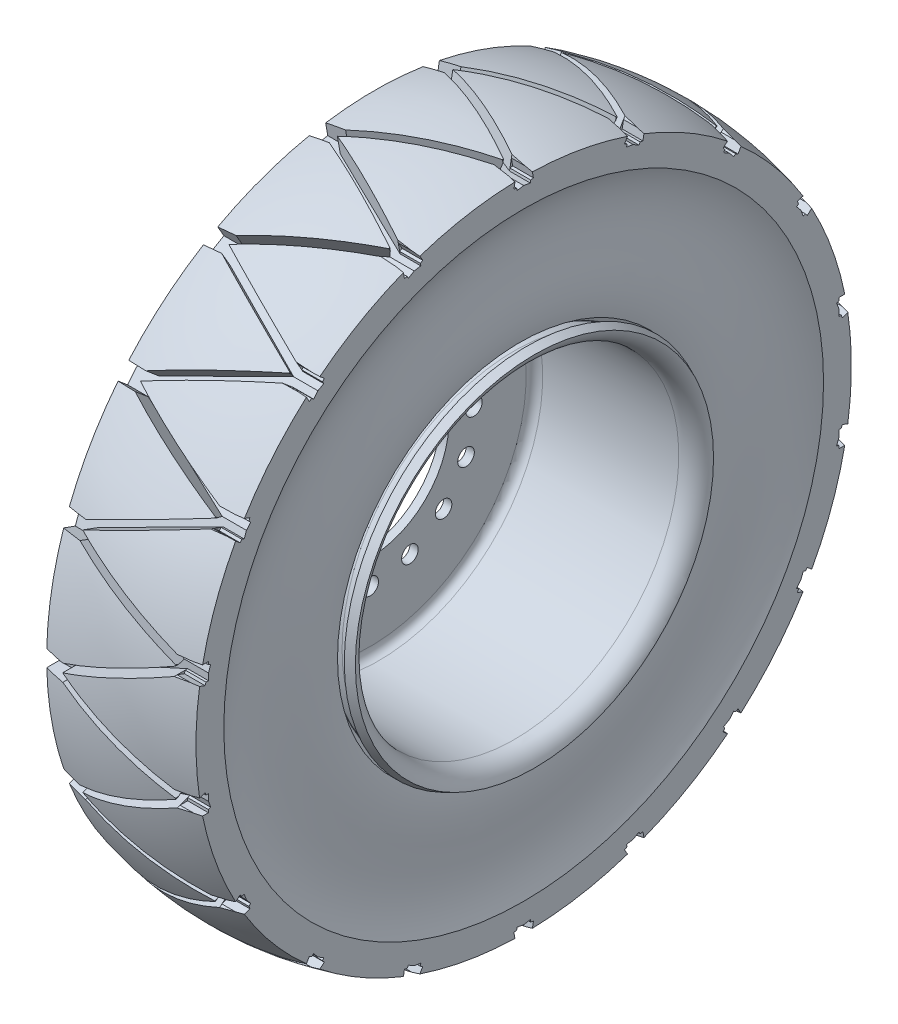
from build123d import *

# Parameters (mm, degrees)
SKETCH2_R          = 10
CUT_EXTRUDE1_DEPTH = 609.373625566
CIRPATTERN1_COUNT  = 16
CUT_EXTRUDE2_DEPTH = 30
CIRPATTERN7_COUNT  = 18


with BuildPart() as part:
    # Sketch1 → Revolve1 (revolve)
    with BuildSketch(Plane.XY, mode=Mode.PRIVATE) as revolve1_sk:
        with BuildLine():
            add(Edge.make_bspline(
                [(4.420797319, 220), (-4.59658373, 267.324256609), (21.252446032, 315.26572563), (0, 361.469554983)],
                knots=[0, 0, 0, 0, 1, 1, 1, 1], degree=3))
            Line((0, 361.469554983), (0, 395))
            ThreePointArc((0, 395), (90, 406.769309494), (180, 395))
            Line((180, 395), (180, 361.469554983))
            add(Edge.make_bspline(
                [(175.579202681, 220), (184.59658373, 267.324256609), (158.747553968, 315.26572563), (180, 361.469554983)],
                knots=[0, 0, 0, 0, 1, 1, 1, 1], degree=3))
            Line((175.579202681, 220), (163.378041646, 220))
            Line((163.378041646, 220), (159.354497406, 210.18192571))
            ThreePointArc((159.354497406, 210.18192571), (158.618138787, 209.27948633), (157.503870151, 208.940331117))
            Line((157.503870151, 208.940331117), (24.508844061, 208.940331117))
            ThreePointArc((24.508844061, 208.940331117), (21.723172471, 209.788219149), (19.882275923, 212.044317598))
            Line((19.882275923, 212.044317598), (16.621958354, 220))
            Line((16.621958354, 220), (4.420797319, 220))
        make_face()
        with BuildLine():
            ThreePointArc((-15, 187.940331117), (-9.142135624, 202.082466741), (5, 207.940331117))
            Line((5, 207.940331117), (151.915463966, 207.940331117))
            Line((151.915463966, 207.940331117), (169, 207.940331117))
            ThreePointArc((169, 207.940331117), (178.489717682, 211.323737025), (183.698426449, 219.94763001))
            Line((183.698426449, 219.94763001), (192.979609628, 215.870796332))
            ThreePointArc((192.979609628, 215.870796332), (183.970999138, 202.918613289), (169, 197.940331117))
            Line((169, 197.940331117), (151.915463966, 197.940331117))
            Line((151.915463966, 197.940331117), (5, 197.940331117))
            ThreePointArc((5, 197.940331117), (-2.071067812, 195.011398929), (-5, 187.940331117))
            Line((-5, 187.940331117), (-5, 162.003559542))
            Line((-5, 162.003559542), (-5, 95))
            Line((-5, 95), (-15, 95))
            Line((-15, 95), (-15, 162.003559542))
            Line((-15, 162.003559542), (-15, 187.940331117))
        make_face()
    revolve(revolve1_sk.sketch.rotate(Axis((0, 0, 0), (1, 0, 0)), 90), axis=Axis((0, 0, 0), (1, 0, 0)))

    # Sketch2 → Cut-Extrude1 (cut, through all)
    with BuildSketch(Plane(origin=(-5, 0, 0), x_dir=(0, 0, -1), z_dir=(1, 0, 0))):
        with Locations((0, 125)):
            Circle(SKETCH2_R)
    cut_extrude1 = extrude(amount=-CUT_EXTRUDE1_DEPTH, mode=Mode.SUBTRACT)

    # CirPattern1: Cut-Extrude1 ×16 about axis
    cirpattern1_axis = Axis((0, 0, 0), (1, 0, 0))
    for i in range(1, CIRPATTERN1_COUNT):
        add(cut_extrude1.rotate(cirpattern1_axis, i * 360 / CIRPATTERN1_COUNT), mode=Mode.SUBTRACT)

    # Sketch4 → Cut-Extrude2 (cut)
    with BuildSketch(Plane.XY.offset(410)):
        Polygon((180, -58.94), (155, -58.94), (25, 0), (155, 58.94), (180, 58.94), (180, 68.94), (180, 78.94), (155, 78.94), (155, 68.94), (25, 10), (0, 10), (0, -10), (25, -10), (155, -68.94), (155, -78.94), (180, -78.94), (180, -68.94), align=None)
    cut_extrude2 = extrude(amount=-CUT_EXTRUDE2_DEPTH, mode=Mode.SUBTRACT)

    # CirPattern7: Cut-Extrude2 ×18 about axis
    cirpattern7_axis = Axis((0, 0, 0), (1, 0, 0))
    for i in range(1, CIRPATTERN7_COUNT):
        add(cut_extrude2.rotate(cirpattern7_axis, i * 360 / CIRPATTERN7_COUNT), mode=Mode.SUBTRACT)


solid = part.part
